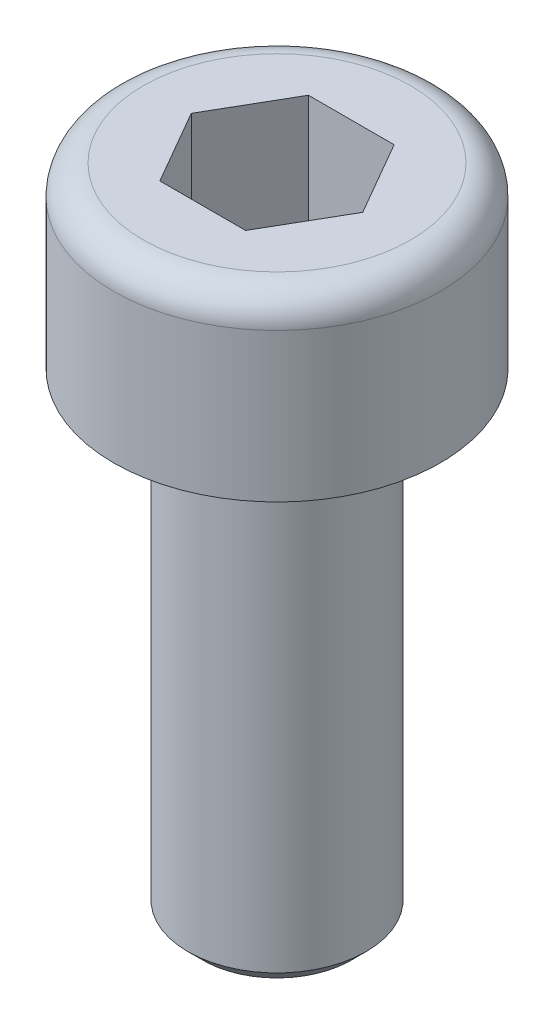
ISO-10303-21;
HEADER;
FILE_DESCRIPTION(('STEP AP214'),'2;1');
FILE_NAME('part.step','',(''),(''),'','','');
FILE_SCHEMA(('AUTOMOTIVE_DESIGN { 1 0 10303 214 1 1 1 1 }'));
ENDSEC;
DATA;
#1=APPLICATION_CONTEXT('core data for automotive mechanical design processes');
#2=APPLICATION_PROTOCOL_DEFINITION('international standard','automotive_design',2000,#1);
#3=PRODUCT_CONTEXT('',#1,'mechanical');
#4=PRODUCT('Part','Part','',(#3));
#5=PRODUCT_RELATED_PRODUCT_CATEGORY('part','',(#4));
#6=PRODUCT_DEFINITION_FORMATION('','',#4);
#7=PRODUCT_DEFINITION_CONTEXT('part definition',#1,'design');
#8=PRODUCT_DEFINITION('design','',#6,#7);
#9=PRODUCT_DEFINITION_SHAPE('','',#8);
#10=(LENGTH_UNIT() NAMED_UNIT(*) SI_UNIT(.MILLI.,.METRE.));
#11=(NAMED_UNIT(*) PLANE_ANGLE_UNIT() SI_UNIT($,.RADIAN.));
#12=(NAMED_UNIT(*) SI_UNIT($,.STERADIAN.) SOLID_ANGLE_UNIT());
#13=UNCERTAINTY_MEASURE_WITH_UNIT(LENGTH_MEASURE(1.E-05),#10,'distance_accuracy_value','');
#14=(GEOMETRIC_REPRESENTATION_CONTEXT(3) GLOBAL_UNCERTAINTY_ASSIGNED_CONTEXT((#13)) GLOBAL_UNIT_ASSIGNED_CONTEXT((#10,
#11,#12)) REPRESENTATION_CONTEXT('',''));
#15=CARTESIAN_POINT('',(0.,0.,0.));
#16=DIRECTION('',(0.,0.,1.));
#17=DIRECTION('',(1.,0.,0.));
#18=AXIS2_PLACEMENT_3D('',#15,#16,#17);
#19=CARTESIAN_POINT('',(0.,11.,0.));
#20=DIRECTION('',(0.,1.,0.));
#21=DIRECTION('',(0.,0.,1.));
#22=AXIS2_PLACEMENT_3D('',#19,#20,#21);
#23=PLANE('',#22);
#24=CARTESIAN_POINT('',(0.,11.,0.));
#25=DIRECTION('',(0.,1.,0.));
#26=DIRECTION('',(0.,0.,1.));
#27=AXIS2_PLACEMENT_3D('',#24,#25,#26);
#28=CIRCLE('',#27,2.24999999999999);
#29=CARTESIAN_POINT('',(0.,11.,2.24999999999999));
#30=VERTEX_POINT('',#29);
#31=EDGE_CURVE('E97',#30,#30,#28,.T.);
#32=ORIENTED_EDGE('',*,*,#31,.T.);
#33=EDGE_LOOP('',(#32));
#34=FACE_BOUND('',#33,.T.);
#35=DIRECTION('',(0.5,0.,-0.866025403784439));
#36=VECTOR('',#35,1.);
#37=CARTESIAN_POINT('',(-1.44337567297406,11.,0.));
#38=LINE('',#37,#36);
#39=CARTESIAN_POINT('',(-1.44337567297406,11.,0.));
#40=VERTEX_POINT('',#39);
#41=CARTESIAN_POINT('',(-0.721687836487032,11.,-1.25));
#42=VERTEX_POINT('',#41);
#43=EDGE_CURVE('E102',#40,#42,#38,.T.);
#44=ORIENTED_EDGE('',*,*,#43,.T.);
#45=DIRECTION('',(1.,0.,0.));
#46=VECTOR('',#45,1.);
#47=CARTESIAN_POINT('',(-0.721687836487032,11.,-1.25));
#48=LINE('',#47,#46);
#49=CARTESIAN_POINT('',(0.721687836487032,11.,-1.25));
#50=VERTEX_POINT('',#49);
#51=EDGE_CURVE('E43',#42,#50,#48,.T.);
#52=ORIENTED_EDGE('',*,*,#51,.T.);
#53=DIRECTION('',(0.5,0.,0.866025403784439));
#54=VECTOR('',#53,1.);
#55=CARTESIAN_POINT('',(0.721687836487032,11.,-1.25));
#56=LINE('',#55,#54);
#57=CARTESIAN_POINT('',(1.44337567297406,11.,0.));
#58=VERTEX_POINT('',#57);
#59=EDGE_CURVE('E83',#50,#58,#56,.T.);
#60=ORIENTED_EDGE('',*,*,#59,.T.);
#61=DIRECTION('',(-0.5,0.,0.866025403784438));
#62=VECTOR('',#61,1.);
#63=CARTESIAN_POINT('',(1.44337567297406,11.,0.));
#64=LINE('',#63,#62);
#65=CARTESIAN_POINT('',(0.721687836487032,11.,1.25));
#66=VERTEX_POINT('',#65);
#67=EDGE_CURVE('E91',#58,#66,#64,.T.);
#68=ORIENTED_EDGE('',*,*,#67,.T.);
#69=DIRECTION('',(-1.,0.,0.));
#70=VECTOR('',#69,1.);
#71=CARTESIAN_POINT('',(0.721687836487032,11.,1.25));
#72=LINE('',#71,#70);
#73=CARTESIAN_POINT('',(-0.721687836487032,11.,1.25));
#74=VERTEX_POINT('',#73);
#75=EDGE_CURVE('E106',#66,#74,#72,.T.);
#76=ORIENTED_EDGE('',*,*,#75,.T.);
#77=DIRECTION('',(-0.5,0.,-0.866025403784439));
#78=VECTOR('',#77,1.);
#79=CARTESIAN_POINT('',(-0.721687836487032,11.,1.25));
#80=LINE('',#79,#78);
#81=EDGE_CURVE('E109',#74,#40,#80,.T.);
#82=ORIENTED_EDGE('',*,*,#81,.T.);
#83=EDGE_LOOP('',(#44,#52,#60,#68,#76,#82));
#84=FACE_BOUND('',#83,.T.);
#85=ADVANCED_FACE('F28',(#34,#84),#23,.T.);
#86=CARTESIAN_POINT('',(-1.49999999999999,0.,0.));
#87=DIRECTION('',(0.,-1.,0.));
#88=DIRECTION('',(0.,0.,-1.));
#89=AXIS2_PLACEMENT_3D('',#86,#87,#88);
#90=PLANE('',#89);
#91=CARTESIAN_POINT('',(0.,0.,0.));
#92=DIRECTION('',(0.,-1.,0.));
#93=DIRECTION('',(0.,0.,-1.));
#94=AXIS2_PLACEMENT_3D('',#91,#92,#93);
#95=CIRCLE('',#94,1.24999999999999);
#96=CARTESIAN_POINT('',(0.,0.,-1.24999999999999));
#97=VERTEX_POINT('',#96);
#98=EDGE_CURVE('E11',#97,#97,#95,.T.);
#99=ORIENTED_EDGE('',*,*,#98,.T.);
#100=EDGE_LOOP('',(#99));
#101=FACE_BOUND('',#100,.T.);
#102=ADVANCED_FACE('F30',(#101),#90,.T.);
#103=CARTESIAN_POINT('',(0.,20.9898291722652,0.));
#104=DIRECTION('',(0.,1.,0.));
#105=DIRECTION('',(0.,0.,1.));
#106=AXIS2_PLACEMENT_3D('',#103,#104,#105);
#107=CYLINDRICAL_SURFACE('',#106,1.49999999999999);
#108=CARTESIAN_POINT('',(0.,0.250000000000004,0.));
#109=DIRECTION('',(0.,-1.,0.));
#110=DIRECTION('',(0.,0.,-1.));
#111=AXIS2_PLACEMENT_3D('',#108,#109,#110);
#112=CIRCLE('',#111,1.49999999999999);
#113=CARTESIAN_POINT('',(0.,0.250000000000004,-1.49999999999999));
#114=VERTEX_POINT('',#113);
#115=EDGE_CURVE('E36',#114,#114,#112,.F.);
#116=ORIENTED_EDGE('',*,*,#115,.T.);
#117=EDGE_LOOP('',(#116));
#118=FACE_BOUND('',#117,.T.);
#119=CARTESIAN_POINT('',(0.,8.,0.));
#120=DIRECTION('',(0.,1.,0.));
#121=DIRECTION('',(0.,0.,1.));
#122=AXIS2_PLACEMENT_3D('',#119,#120,#121);
#123=CIRCLE('',#122,1.49999999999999);
#124=CARTESIAN_POINT('',(0.,8.,1.49999999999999));
#125=VERTEX_POINT('',#124);
#126=EDGE_CURVE('E139',#125,#125,#123,.T.);
#127=ORIENTED_EDGE('',*,*,#126,.F.);
#128=EDGE_LOOP('',(#127));
#129=FACE_BOUND('',#128,.T.);
#130=ADVANCED_FACE('F144',(#118,#129),#107,.T.);
#131=CARTESIAN_POINT('',(-2.74999999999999,8.,0.));
#132=DIRECTION('',(0.,-1.,0.));
#133=DIRECTION('',(0.,0.,-1.));
#134=AXIS2_PLACEMENT_3D('',#131,#132,#133);
#135=PLANE('',#134);
#136=ORIENTED_EDGE('',*,*,#126,.T.);
#137=EDGE_LOOP('',(#136));
#138=FACE_BOUND('',#137,.T.);
#139=CARTESIAN_POINT('',(0.,8.,0.));
#140=DIRECTION('',(0.,1.,0.));
#141=DIRECTION('',(0.,0.,1.));
#142=AXIS2_PLACEMENT_3D('',#139,#140,#141);
#143=CIRCLE('',#142,2.74999999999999);
#144=CARTESIAN_POINT('',(0.,8.,2.74999999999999));
#145=VERTEX_POINT('',#144);
#146=EDGE_CURVE('E136',#145,#145,#143,.T.);
#147=ORIENTED_EDGE('',*,*,#146,.F.);
#148=EDGE_LOOP('',(#147));
#149=FACE_BOUND('',#148,.T.);
#150=ADVANCED_FACE('F176',(#138,#149),#135,.T.);
#151=CARTESIAN_POINT('',(0.,20.9898291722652,0.));
#152=DIRECTION('',(0.,1.,0.));
#153=DIRECTION('',(0.,0.,1.));
#154=AXIS2_PLACEMENT_3D('',#151,#152,#153);
#155=CYLINDRICAL_SURFACE('',#154,2.74999999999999);
#156=ORIENTED_EDGE('',*,*,#146,.T.);
#157=EDGE_LOOP('',(#156));
#158=FACE_BOUND('',#157,.T.);
#159=CARTESIAN_POINT('',(0.,10.5,0.));
#160=DIRECTION('',(0.,1.,0.));
#161=DIRECTION('',(0.,0.,1.));
#162=AXIS2_PLACEMENT_3D('',#159,#160,#161);
#163=CIRCLE('',#162,2.74999999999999);
#164=CARTESIAN_POINT('',(0.,10.5,2.74999999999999));
#165=VERTEX_POINT('',#164);
#166=EDGE_CURVE('E133',#165,#165,#163,.T.);
#167=ORIENTED_EDGE('',*,*,#166,.F.);
#168=EDGE_LOOP('',(#167));
#169=FACE_BOUND('',#168,.T.);
#170=ADVANCED_FACE('F172',(#158,#169),#155,.T.);
#171=CARTESIAN_POINT('',(0.,10.5,0.));
#172=DIRECTION('',(0.,1.,0.));
#173=DIRECTION('',(0.,0.,1.));
#174=AXIS2_PLACEMENT_3D('',#171,#172,#173);
#175=TOROIDAL_SURFACE('',#174,2.24999999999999,0.5);
#176=ORIENTED_EDGE('',*,*,#31,.F.);
#177=EDGE_LOOP('',(#176));
#178=FACE_BOUND('',#177,.T.);
#179=ORIENTED_EDGE('',*,*,#166,.T.);
#180=EDGE_LOOP('',(#179));
#181=FACE_BOUND('',#180,.T.);
#182=ADVANCED_FACE('F169',(#178,#181),#175,.T.);
#183=CARTESIAN_POINT('',(-0.721687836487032,9.,-1.25));
#184=DIRECTION('',(0.,0.,1.));
#185=DIRECTION('',(1.,0.,0.));
#186=AXIS2_PLACEMENT_3D('',#183,#184,#185);
#187=PLANE('',#186);
#188=ORIENTED_EDGE('',*,*,#51,.F.);
#189=DIRECTION('',(0.,1.,0.));
#190=VECTOR('',#189,1.);
#191=CARTESIAN_POINT('',(-0.721687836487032,9.,-1.25));
#192=LINE('',#191,#190);
#193=CARTESIAN_POINT('',(-0.721687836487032,9.,-1.25));
#194=VERTEX_POINT('',#193);
#195=EDGE_CURVE('E122',#194,#42,#192,.T.);
#196=ORIENTED_EDGE('',*,*,#195,.F.);
#197=DIRECTION('',(1.,0.,0.));
#198=VECTOR('',#197,1.);
#199=CARTESIAN_POINT('',(-0.721687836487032,9.,-1.25));
#200=LINE('',#199,#198);
#201=CARTESIAN_POINT('',(0.721687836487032,9.,-1.25));
#202=VERTEX_POINT('',#201);
#203=EDGE_CURVE('E96',#194,#202,#200,.T.);
#204=ORIENTED_EDGE('',*,*,#203,.T.);
#205=DIRECTION('',(0.,1.,0.));
#206=VECTOR('',#205,1.);
#207=CARTESIAN_POINT('',(0.721687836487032,9.,-1.25));
#208=LINE('',#207,#206);
#209=EDGE_CURVE('E85',#202,#50,#208,.T.);
#210=ORIENTED_EDGE('',*,*,#209,.T.);
#211=EDGE_LOOP('',(#188,#196,#204,#210));
#212=FACE_BOUND('',#211,.T.);
#213=ADVANCED_FACE('F94',(#212),#187,.T.);
#214=CARTESIAN_POINT('',(0.721687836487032,9.,-1.25));
#215=DIRECTION('',(-0.866025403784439,0.,0.5));
#216=DIRECTION('',(0.5,0.,0.866025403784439));
#217=AXIS2_PLACEMENT_3D('',#214,#215,#216);
#218=PLANE('',#217);
#219=ORIENTED_EDGE('',*,*,#59,.F.);
#220=ORIENTED_EDGE('',*,*,#209,.F.);
#221=DIRECTION('',(0.5,0.,0.866025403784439));
#222=VECTOR('',#221,1.);
#223=CARTESIAN_POINT('',(0.721687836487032,9.,-1.25));
#224=LINE('',#223,#222);
#225=CARTESIAN_POINT('',(1.44337567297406,9.,0.));
#226=VERTEX_POINT('',#225);
#227=EDGE_CURVE('E113',#202,#226,#224,.T.);
#228=ORIENTED_EDGE('',*,*,#227,.T.);
#229=DIRECTION('',(0.,1.,0.));
#230=VECTOR('',#229,1.);
#231=CARTESIAN_POINT('',(1.44337567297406,9.,0.));
#232=LINE('',#231,#230);
#233=EDGE_CURVE('E87',#226,#58,#232,.T.);
#234=ORIENTED_EDGE('',*,*,#233,.T.);
#235=EDGE_LOOP('',(#219,#220,#228,#234));
#236=FACE_BOUND('',#235,.T.);
#237=ADVANCED_FACE('F84',(#236),#218,.T.);
#238=CARTESIAN_POINT('',(1.44337567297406,9.,0.));
#239=DIRECTION('',(-0.866025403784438,0.,-0.5));
#240=DIRECTION('',(-0.5,0.,0.866025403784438));
#241=AXIS2_PLACEMENT_3D('',#238,#239,#240);
#242=PLANE('',#241);
#243=ORIENTED_EDGE('',*,*,#67,.F.);
#244=ORIENTED_EDGE('',*,*,#233,.F.);
#245=DIRECTION('',(-0.5,0.,0.866025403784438));
#246=VECTOR('',#245,1.);
#247=CARTESIAN_POINT('',(1.44337567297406,9.,0.));
#248=LINE('',#247,#246);
#249=CARTESIAN_POINT('',(0.721687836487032,9.,1.25));
#250=VERTEX_POINT('',#249);
#251=EDGE_CURVE('E115',#226,#250,#248,.T.);
#252=ORIENTED_EDGE('',*,*,#251,.T.);
#253=DIRECTION('',(0.,1.,0.));
#254=VECTOR('',#253,1.);
#255=CARTESIAN_POINT('',(0.721687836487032,9.,1.25));
#256=LINE('',#255,#254);
#257=EDGE_CURVE('E128',#250,#66,#256,.T.);
#258=ORIENTED_EDGE('',*,*,#257,.T.);
#259=EDGE_LOOP('',(#243,#244,#252,#258));
#260=FACE_BOUND('',#259,.T.);
#261=ADVANCED_FACE('F208',(#260),#242,.T.);
#262=CARTESIAN_POINT('',(0.721687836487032,9.,1.25));
#263=DIRECTION('',(0.,0.,-1.));
#264=DIRECTION('',(-1.,0.,0.));
#265=AXIS2_PLACEMENT_3D('',#262,#263,#264);
#266=PLANE('',#265);
#267=ORIENTED_EDGE('',*,*,#75,.F.);
#268=ORIENTED_EDGE('',*,*,#257,.F.);
#269=DIRECTION('',(-1.,0.,0.));
#270=VECTOR('',#269,1.);
#271=CARTESIAN_POINT('',(0.721687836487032,9.,1.25));
#272=LINE('',#271,#270);
#273=CARTESIAN_POINT('',(-0.721687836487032,9.,1.25));
#274=VERTEX_POINT('',#273);
#275=EDGE_CURVE('E117',#250,#274,#272,.T.);
#276=ORIENTED_EDGE('',*,*,#275,.T.);
#277=DIRECTION('',(0.,1.,0.));
#278=VECTOR('',#277,1.);
#279=CARTESIAN_POINT('',(-0.721687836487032,9.,1.25));
#280=LINE('',#279,#278);
#281=EDGE_CURVE('E126',#274,#74,#280,.T.);
#282=ORIENTED_EDGE('',*,*,#281,.T.);
#283=EDGE_LOOP('',(#267,#268,#276,#282));
#284=FACE_BOUND('',#283,.T.);
#285=ADVANCED_FACE('F214',(#284),#266,.T.);
#286=CARTESIAN_POINT('',(-0.721687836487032,9.,1.25));
#287=DIRECTION('',(0.866025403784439,0.,-0.5));
#288=DIRECTION('',(-0.5,0.,-0.866025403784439));
#289=AXIS2_PLACEMENT_3D('',#286,#287,#288);
#290=PLANE('',#289);
#291=ORIENTED_EDGE('',*,*,#81,.F.);
#292=ORIENTED_EDGE('',*,*,#281,.F.);
#293=DIRECTION('',(-0.5,0.,-0.866025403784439));
#294=VECTOR('',#293,1.);
#295=CARTESIAN_POINT('',(-0.721687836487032,9.,1.25));
#296=LINE('',#295,#294);
#297=CARTESIAN_POINT('',(-1.44337567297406,9.,0.));
#298=VERTEX_POINT('',#297);
#299=EDGE_CURVE('E119',#274,#298,#296,.T.);
#300=ORIENTED_EDGE('',*,*,#299,.T.);
#301=DIRECTION('',(0.,1.,0.));
#302=VECTOR('',#301,1.);
#303=CARTESIAN_POINT('',(-1.44337567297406,9.,0.));
#304=LINE('',#303,#302);
#305=EDGE_CURVE('E124',#298,#40,#304,.T.);
#306=ORIENTED_EDGE('',*,*,#305,.T.);
#307=EDGE_LOOP('',(#291,#292,#300,#306));
#308=FACE_BOUND('',#307,.T.);
#309=ADVANCED_FACE('F222',(#308),#290,.T.);
#310=CARTESIAN_POINT('',(-1.44337567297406,9.,0.));
#311=DIRECTION('',(0.866025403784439,0.,0.5));
#312=DIRECTION('',(0.5,0.,-0.866025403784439));
#313=AXIS2_PLACEMENT_3D('',#310,#311,#312);
#314=PLANE('',#313);
#315=ORIENTED_EDGE('',*,*,#43,.F.);
#316=ORIENTED_EDGE('',*,*,#305,.F.);
#317=DIRECTION('',(0.5,0.,-0.866025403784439));
#318=VECTOR('',#317,1.);
#319=CARTESIAN_POINT('',(-1.44337567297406,9.,0.));
#320=LINE('',#319,#318);
#321=EDGE_CURVE('E50',#298,#194,#320,.T.);
#322=ORIENTED_EDGE('',*,*,#321,.T.);
#323=ORIENTED_EDGE('',*,*,#195,.T.);
#324=EDGE_LOOP('',(#315,#316,#322,#323));
#325=FACE_BOUND('',#324,.T.);
#326=ADVANCED_FACE('F155',(#325),#314,.T.);
#327=CARTESIAN_POINT('',(0.721687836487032,9.,-1.25));
#328=DIRECTION('',(0.,-1.,0.));
#329=DIRECTION('',(0.,0.,-1.));
#330=AXIS2_PLACEMENT_3D('',#327,#328,#329);
#331=PLANE('',#330);
#332=ORIENTED_EDGE('',*,*,#203,.F.);
#333=ORIENTED_EDGE('',*,*,#321,.F.);
#334=ORIENTED_EDGE('',*,*,#299,.F.);
#335=ORIENTED_EDGE('',*,*,#275,.F.);
#336=ORIENTED_EDGE('',*,*,#251,.F.);
#337=ORIENTED_EDGE('',*,*,#227,.F.);
#338=EDGE_LOOP('',(#332,#333,#334,#335,#336,#337));
#339=FACE_BOUND('',#338,.T.);
#340=ADVANCED_FACE('F149',(#339),#331,.F.);
#341=CARTESIAN_POINT('',(0.,0.250000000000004,0.));
#342=DIRECTION('',(0.,1.,0.));
#343=DIRECTION('',(0.,0.,1.));
#344=AXIS2_PLACEMENT_3D('',#341,#342,#343);
#345=CONICAL_SURFACE('',#344,1.49999999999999,0.785398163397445);
#346=ORIENTED_EDGE('',*,*,#98,.F.);
#347=EDGE_LOOP('',(#346));
#348=FACE_BOUND('',#347,.T.);
#349=ORIENTED_EDGE('',*,*,#115,.F.);
#350=EDGE_LOOP('',(#349));
#351=FACE_BOUND('',#350,.T.);
#352=ADVANCED_FACE('F147',(#348,#351),#345,.T.);
#353=CLOSED_SHELL('',(#85,#102,#130,#150,#170,#182,#213,#237,#261,#285,#309,#326,#340,#352));
#354=MANIFOLD_SOLID_BREP('B2',#353);
#355=ADVANCED_BREP_SHAPE_REPRESENTATION('',(#18,#354),#14);
#356=SHAPE_DEFINITION_REPRESENTATION(#9,#355);
ENDSEC;
END-ISO-10303-21;
